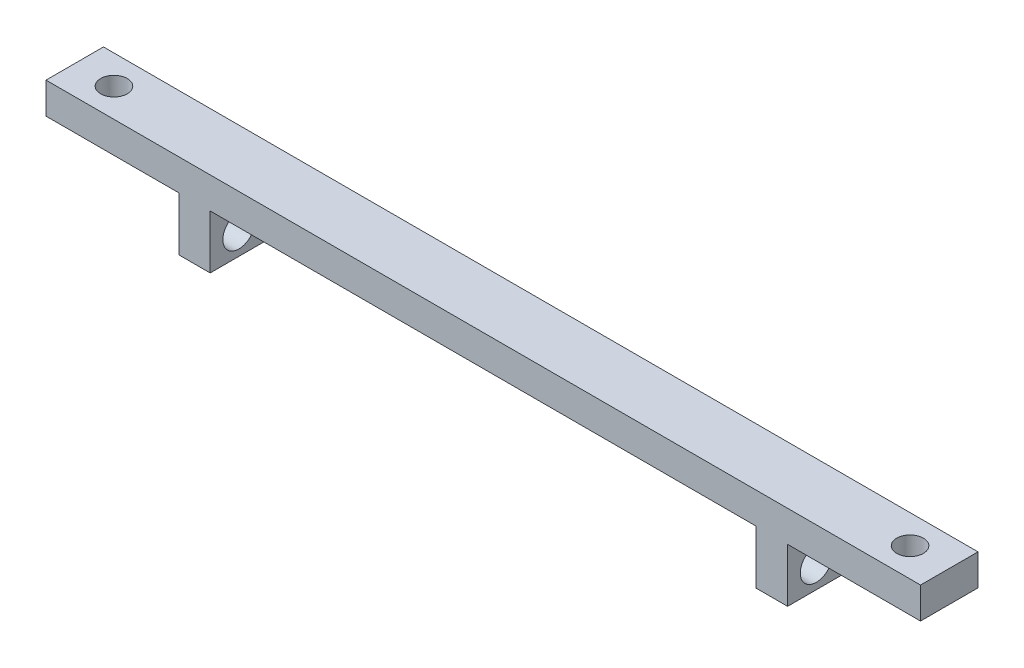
ISO-10303-21;
HEADER;
FILE_DESCRIPTION(('STEP AP214'),'2;1');
FILE_NAME('part.step','',(''),(''),'','','');
FILE_SCHEMA(('AUTOMOTIVE_DESIGN { 1 0 10303 214 1 1 1 1 }'));
ENDSEC;
DATA;
#1=APPLICATION_CONTEXT('core data for automotive mechanical design processes');
#2=APPLICATION_PROTOCOL_DEFINITION('international standard','automotive_design',2000,#1);
#3=PRODUCT_CONTEXT('',#1,'mechanical');
#4=PRODUCT('Part','Part','',(#3));
#5=PRODUCT_RELATED_PRODUCT_CATEGORY('part','',(#4));
#6=PRODUCT_DEFINITION_FORMATION('','',#4);
#7=PRODUCT_DEFINITION_CONTEXT('part definition',#1,'design');
#8=PRODUCT_DEFINITION('design','',#6,#7);
#9=PRODUCT_DEFINITION_SHAPE('','',#8);
#10=(LENGTH_UNIT() NAMED_UNIT(*) SI_UNIT(.MILLI.,.METRE.));
#11=(NAMED_UNIT(*) PLANE_ANGLE_UNIT() SI_UNIT($,.RADIAN.));
#12=(NAMED_UNIT(*) SI_UNIT($,.STERADIAN.) SOLID_ANGLE_UNIT());
#13=UNCERTAINTY_MEASURE_WITH_UNIT(LENGTH_MEASURE(1.E-05),#10,'distance_accuracy_value','');
#14=(GEOMETRIC_REPRESENTATION_CONTEXT(3) GLOBAL_UNCERTAINTY_ASSIGNED_CONTEXT((#13)) GLOBAL_UNIT_ASSIGNED_CONTEXT((#10,
#11,#12)) REPRESENTATION_CONTEXT('',''));
#15=CARTESIAN_POINT('',(0.,0.,0.));
#16=DIRECTION('',(0.,0.,1.));
#17=DIRECTION('',(1.,0.,0.));
#18=AXIS2_PLACEMENT_3D('',#15,#16,#17);
#19=CARTESIAN_POINT('',(0.,0.,-5.842));
#20=DIRECTION('',(0.,-1.,0.));
#21=DIRECTION('',(0.,0.,-1.));
#22=AXIS2_PLACEMENT_3D('',#19,#20,#21);
#23=PLANE('',#22);
#24=DIRECTION('',(0.,0.,1.));
#25=VECTOR('',#24,1.);
#26=CARTESIAN_POINT('',(16.6878,0.,-5.842));
#27=LINE('',#26,#25);
#28=CARTESIAN_POINT('',(16.6878,0.,-5.842));
#29=VERTEX_POINT('',#28);
#30=CARTESIAN_POINT('',(16.6878,0.,0.));
#31=VERTEX_POINT('',#30);
#32=EDGE_CURVE('E212',#29,#31,#27,.T.);
#33=ORIENTED_EDGE('',*,*,#32,.T.);
#34=DIRECTION('',(1.,0.,0.));
#35=VECTOR('',#34,1.);
#36=CARTESIAN_POINT('',(0.,0.,0.));
#37=LINE('',#36,#35);
#38=CARTESIAN_POINT('',(13.5128,0.,0.));
#39=VERTEX_POINT('',#38);
#40=EDGE_CURVE('E176',#39,#31,#37,.T.);
#41=ORIENTED_EDGE('',*,*,#40,.F.);
#42=DIRECTION('',(0.,0.,1.));
#43=VECTOR('',#42,1.);
#44=CARTESIAN_POINT('',(13.5128,0.,-5.842));
#45=LINE('',#44,#43);
#46=CARTESIAN_POINT('',(13.5128,0.,-5.842));
#47=VERTEX_POINT('',#46);
#48=EDGE_CURVE('E233',#47,#39,#45,.T.);
#49=ORIENTED_EDGE('',*,*,#48,.F.);
#50=DIRECTION('',(1.,0.,0.));
#51=VECTOR('',#50,1.);
#52=CARTESIAN_POINT('',(0.,0.,-5.842));
#53=LINE('',#52,#51);
#54=EDGE_CURVE('E157',#47,#29,#53,.T.);
#55=ORIENTED_EDGE('',*,*,#54,.T.);
#56=EDGE_LOOP('',(#33,#41,#49,#55));
#57=FACE_BOUND('',#56,.T.);
#58=ADVANCED_FACE('F43',(#57),#23,.T.);
#59=CARTESIAN_POINT('',(0.,0.,-5.842));
#60=DIRECTION('',(-1.,0.,0.));
#61=DIRECTION('',(0.,0.,1.));
#62=AXIS2_PLACEMENT_3D('',#59,#60,#61);
#63=PLANE('',#62);
#64=DIRECTION('',(0.,0.,1.));
#65=VECTOR('',#64,1.);
#66=CARTESIAN_POINT('',(0.,5.461,-5.842));
#67=LINE('',#66,#65);
#68=CARTESIAN_POINT('',(0.,5.461,-5.842));
#69=VERTEX_POINT('',#68);
#70=CARTESIAN_POINT('',(0.,5.461,0.));
#71=VERTEX_POINT('',#70);
#72=EDGE_CURVE('E175',#69,#71,#67,.T.);
#73=ORIENTED_EDGE('',*,*,#72,.T.);
#74=DIRECTION('',(0.,-1.,0.));
#75=VECTOR('',#74,1.);
#76=CARTESIAN_POINT('',(0.,0.,0.));
#77=LINE('',#76,#75);
#78=CARTESIAN_POINT('',(0.,8.636,0.));
#79=VERTEX_POINT('',#78);
#80=EDGE_CURVE('E171',#79,#71,#77,.T.);
#81=ORIENTED_EDGE('',*,*,#80,.F.);
#82=DIRECTION('',(0.,0.,1.));
#83=VECTOR('',#82,1.);
#84=CARTESIAN_POINT('',(0.,8.636,-5.842));
#85=LINE('',#84,#83);
#86=CARTESIAN_POINT('',(0.,8.636,-5.842));
#87=VERTEX_POINT('',#86);
#88=EDGE_CURVE('E13',#87,#79,#85,.T.);
#89=ORIENTED_EDGE('',*,*,#88,.F.);
#90=DIRECTION('',(0.,-1.,0.));
#91=VECTOR('',#90,1.);
#92=CARTESIAN_POINT('',(0.,0.,-5.842));
#93=LINE('',#92,#91);
#94=EDGE_CURVE('E158',#87,#69,#93,.T.);
#95=ORIENTED_EDGE('',*,*,#94,.T.);
#96=EDGE_LOOP('',(#73,#81,#89,#95));
#97=FACE_BOUND('',#96,.T.);
#98=ADVANCED_FACE('F45',(#97),#63,.T.);
#99=CARTESIAN_POINT('',(0.,8.636,-5.842));
#100=DIRECTION('',(0.,1.,0.));
#101=DIRECTION('',(0.,0.,1.));
#102=AXIS2_PLACEMENT_3D('',#99,#100,#101);
#103=PLANE('',#102);
#104=CARTESIAN_POINT('',(3.9878,8.636,-2.921));
#105=DIRECTION('',(0.,1.,0.));
#106=DIRECTION('',(0.,0.,1.));
#107=AXIS2_PLACEMENT_3D('',#104,#105,#106);
#108=CIRCLE('',#107,1.35254999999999);
#109=CARTESIAN_POINT('',(3.9878,8.636,-1.56845000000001));
#110=VERTEX_POINT('',#109);
#111=EDGE_CURVE('E303',#110,#110,#108,.T.);
#112=ORIENTED_EDGE('',*,*,#111,.F.);
#113=EDGE_LOOP('',(#112));
#114=FACE_BOUND('',#113,.T.);
#115=CARTESIAN_POINT('',(84.9122,8.636,-2.921));
#116=DIRECTION('',(0.,1.,0.));
#117=DIRECTION('',(0.,0.,1.));
#118=AXIS2_PLACEMENT_3D('',#115,#116,#117);
#119=CIRCLE('',#118,1.35254999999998);
#120=CARTESIAN_POINT('',(84.9122,8.636,-1.56845000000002));
#121=VERTEX_POINT('',#120);
#122=EDGE_CURVE('E316',#121,#121,#119,.T.);
#123=ORIENTED_EDGE('',*,*,#122,.F.);
#124=EDGE_LOOP('',(#123));
#125=FACE_BOUND('',#124,.T.);
#126=DIRECTION('',(-1.,0.,0.));
#127=VECTOR('',#126,1.);
#128=CARTESIAN_POINT('',(0.,8.636,0.));
#129=LINE('',#128,#127);
#130=CARTESIAN_POINT('',(88.9,8.636,0.));
#131=VERTEX_POINT('',#130);
#132=EDGE_CURVE('E163',#131,#79,#129,.T.);
#133=ORIENTED_EDGE('',*,*,#132,.F.);
#134=DIRECTION('',(0.,0.,1.));
#135=VECTOR('',#134,1.);
#136=CARTESIAN_POINT('',(88.9,8.636,-5.842));
#137=LINE('',#136,#135);
#138=CARTESIAN_POINT('',(88.9,8.636,-5.842));
#139=VERTEX_POINT('',#138);
#140=EDGE_CURVE('E52',#139,#131,#137,.T.);
#141=ORIENTED_EDGE('',*,*,#140,.F.);
#142=DIRECTION('',(-1.,0.,0.));
#143=VECTOR('',#142,1.);
#144=CARTESIAN_POINT('',(0.,8.636,-5.842));
#145=LINE('',#144,#143);
#146=EDGE_CURVE('E168',#139,#87,#145,.T.);
#147=ORIENTED_EDGE('',*,*,#146,.T.);
#148=ORIENTED_EDGE('',*,*,#88,.T.);
#149=EDGE_LOOP('',(#133,#141,#147,#148));
#150=FACE_BOUND('',#149,.T.);
#151=ADVANCED_FACE('F190',(#114,#125,#150),#103,.T.);
#152=CARTESIAN_POINT('',(88.9,0.,-5.842));
#153=DIRECTION('',(1.,0.,0.));
#154=DIRECTION('',(0.,0.,-1.));
#155=AXIS2_PLACEMENT_3D('',#152,#153,#154);
#156=PLANE('',#155);
#157=DIRECTION('',(0.,0.,1.));
#158=VECTOR('',#157,1.);
#159=CARTESIAN_POINT('',(88.9,5.461,-5.842));
#160=LINE('',#159,#158);
#161=CARTESIAN_POINT('',(88.9,5.461,-5.842));
#162=VERTEX_POINT('',#161);
#163=CARTESIAN_POINT('',(88.9,5.461,0.));
#164=VERTEX_POINT('',#163);
#165=EDGE_CURVE('E60',#162,#164,#160,.T.);
#166=ORIENTED_EDGE('',*,*,#165,.F.);
#167=DIRECTION('',(0.,1.,0.));
#168=VECTOR('',#167,1.);
#169=CARTESIAN_POINT('',(88.9,0.,-5.842));
#170=LINE('',#169,#168);
#171=EDGE_CURVE('E161',#162,#139,#170,.T.);
#172=ORIENTED_EDGE('',*,*,#171,.T.);
#173=ORIENTED_EDGE('',*,*,#140,.T.);
#174=DIRECTION('',(0.,1.,0.));
#175=VECTOR('',#174,1.);
#176=CARTESIAN_POINT('',(88.9,0.,0.));
#177=LINE('',#176,#175);
#178=EDGE_CURVE('E179',#164,#131,#177,.T.);
#179=ORIENTED_EDGE('',*,*,#178,.F.);
#180=EDGE_LOOP('',(#166,#172,#173,#179));
#181=FACE_BOUND('',#180,.T.);
#182=ADVANCED_FACE('F187',(#181),#156,.T.);
#183=DIRECTION('',(0.,0.,1.));
#184=VECTOR('',#183,1.);
#185=CARTESIAN_POINT('',(75.3872,0.,-5.842));
#186=LINE('',#185,#184);
#187=CARTESIAN_POINT('',(75.3872,0.,-5.842));
#188=VERTEX_POINT('',#187);
#189=CARTESIAN_POINT('',(75.3872,0.,0.));
#190=VERTEX_POINT('',#189);
#191=EDGE_CURVE('E135',#188,#190,#186,.T.);
#192=ORIENTED_EDGE('',*,*,#191,.T.);
#193=CARTESIAN_POINT('',(72.1868,0.,0.));
#194=VERTEX_POINT('',#193);
#195=EDGE_CURVE('E174',#194,#190,#37,.T.);
#196=ORIENTED_EDGE('',*,*,#195,.F.);
#197=DIRECTION('',(0.,0.,1.));
#198=VECTOR('',#197,1.);
#199=CARTESIAN_POINT('',(72.1868,0.,-5.842));
#200=LINE('',#199,#198);
#201=CARTESIAN_POINT('',(72.1868,0.,-5.842));
#202=VERTEX_POINT('',#201);
#203=EDGE_CURVE('E68',#202,#194,#200,.T.);
#204=ORIENTED_EDGE('',*,*,#203,.F.);
#205=EDGE_CURVE('E152',#202,#188,#53,.T.);
#206=ORIENTED_EDGE('',*,*,#205,.T.);
#207=EDGE_LOOP('',(#192,#196,#204,#206));
#208=FACE_BOUND('',#207,.T.);
#209=ADVANCED_FACE('F156',(#208),#23,.T.);
#210=CARTESIAN_POINT('',(0.,8.636,-5.842));
#211=DIRECTION('',(0.,0.,-1.));
#212=DIRECTION('',(-1.,0.,0.));
#213=AXIS2_PLACEMENT_3D('',#210,#211,#212);
#214=PLANE('',#213);
#215=DIRECTION('',(0.,-1.,0.));
#216=VECTOR('',#215,1.);
#217=CARTESIAN_POINT('',(75.3872,0.,-5.842));
#218=LINE('',#217,#216);
#219=CARTESIAN_POINT('',(75.3872,5.461,-5.842));
#220=VERTEX_POINT('',#219);
#221=EDGE_CURVE('E138',#220,#188,#218,.T.);
#222=ORIENTED_EDGE('',*,*,#221,.T.);
#223=ORIENTED_EDGE('',*,*,#205,.F.);
#224=DIRECTION('',(0.,1.,0.));
#225=VECTOR('',#224,1.);
#226=CARTESIAN_POINT('',(72.1868,0.,-5.842));
#227=LINE('',#226,#225);
#228=CARTESIAN_POINT('',(72.1868,5.461,-5.842));
#229=VERTEX_POINT('',#228);
#230=EDGE_CURVE('E206',#202,#229,#227,.T.);
#231=ORIENTED_EDGE('',*,*,#230,.T.);
#232=DIRECTION('',(-1.,0.,0.));
#233=VECTOR('',#232,1.);
#234=CARTESIAN_POINT('',(16.6878,5.461,-5.842));
#235=LINE('',#234,#233);
#236=CARTESIAN_POINT('',(16.6878,5.461,-5.842));
#237=VERTEX_POINT('',#236);
#238=EDGE_CURVE('E209',#229,#237,#235,.T.);
#239=ORIENTED_EDGE('',*,*,#238,.T.);
#240=DIRECTION('',(0.,-1.,0.));
#241=VECTOR('',#240,1.);
#242=CARTESIAN_POINT('',(16.6878,0.,-5.842));
#243=LINE('',#242,#241);
#244=EDGE_CURVE('E203',#237,#29,#243,.T.);
#245=ORIENTED_EDGE('',*,*,#244,.T.);
#246=ORIENTED_EDGE('',*,*,#54,.F.);
#247=DIRECTION('',(0.,1.,0.));
#248=VECTOR('',#247,1.);
#249=CARTESIAN_POINT('',(13.5128,0.,-5.842));
#250=LINE('',#249,#248);
#251=CARTESIAN_POINT('',(13.5128,5.461,-5.842));
#252=VERTEX_POINT('',#251);
#253=EDGE_CURVE('E226',#47,#252,#250,.T.);
#254=ORIENTED_EDGE('',*,*,#253,.T.);
#255=DIRECTION('',(-1.,0.,0.));
#256=VECTOR('',#255,1.);
#257=CARTESIAN_POINT('',(0.,5.461,-5.842));
#258=LINE('',#257,#256);
#259=EDGE_CURVE('E229',#252,#69,#258,.T.);
#260=ORIENTED_EDGE('',*,*,#259,.T.);
#261=ORIENTED_EDGE('',*,*,#94,.F.);
#262=ORIENTED_EDGE('',*,*,#146,.F.);
#263=ORIENTED_EDGE('',*,*,#171,.F.);
#264=DIRECTION('',(-1.,0.,0.));
#265=VECTOR('',#264,1.);
#266=CARTESIAN_POINT('',(75.3872,5.461,-5.842));
#267=LINE('',#266,#265);
#268=EDGE_CURVE('E146',#162,#220,#267,.T.);
#269=ORIENTED_EDGE('',*,*,#268,.T.);
#270=EDGE_LOOP('',(#222,#223,#231,#239,#245,#246,#254,#260,#261,#262,#263,#269));
#271=FACE_BOUND('',#270,.T.);
#272=ADVANCED_FACE('F150',(#271),#214,.T.);
#273=CARTESIAN_POINT('',(0.,8.636,0.));
#274=DIRECTION('',(0.,0.,-1.));
#275=DIRECTION('',(-1.,0.,0.));
#276=AXIS2_PLACEMENT_3D('',#273,#274,#275);
#277=PLANE('',#276);
#278=ORIENTED_EDGE('',*,*,#195,.T.);
#279=DIRECTION('',(0.,-1.,0.));
#280=VECTOR('',#279,1.);
#281=CARTESIAN_POINT('',(75.3872,0.,0.));
#282=LINE('',#281,#280);
#283=CARTESIAN_POINT('',(75.3872,5.461,0.));
#284=VERTEX_POINT('',#283);
#285=EDGE_CURVE('E141',#284,#190,#282,.T.);
#286=ORIENTED_EDGE('',*,*,#285,.F.);
#287=DIRECTION('',(-1.,0.,0.));
#288=VECTOR('',#287,1.);
#289=CARTESIAN_POINT('',(75.3872,5.461,0.));
#290=LINE('',#289,#288);
#291=EDGE_CURVE('E154',#164,#284,#290,.T.);
#292=ORIENTED_EDGE('',*,*,#291,.F.);
#293=ORIENTED_EDGE('',*,*,#178,.T.);
#294=ORIENTED_EDGE('',*,*,#132,.T.);
#295=ORIENTED_EDGE('',*,*,#80,.T.);
#296=DIRECTION('',(-1.,0.,0.));
#297=VECTOR('',#296,1.);
#298=CARTESIAN_POINT('',(0.,5.461,0.));
#299=LINE('',#298,#297);
#300=CARTESIAN_POINT('',(13.5128,5.461,0.));
#301=VERTEX_POINT('',#300);
#302=EDGE_CURVE('E230',#301,#71,#299,.T.);
#303=ORIENTED_EDGE('',*,*,#302,.F.);
#304=DIRECTION('',(0.,1.,0.));
#305=VECTOR('',#304,1.);
#306=CARTESIAN_POINT('',(13.5128,0.,0.));
#307=LINE('',#306,#305);
#308=EDGE_CURVE('E220',#39,#301,#307,.T.);
#309=ORIENTED_EDGE('',*,*,#308,.F.);
#310=ORIENTED_EDGE('',*,*,#40,.T.);
#311=DIRECTION('',(0.,-1.,0.));
#312=VECTOR('',#311,1.);
#313=CARTESIAN_POINT('',(16.6878,0.,0.));
#314=LINE('',#313,#312);
#315=CARTESIAN_POINT('',(16.6878,5.461,0.));
#316=VERTEX_POINT('',#315);
#317=EDGE_CURVE('E201',#316,#31,#314,.T.);
#318=ORIENTED_EDGE('',*,*,#317,.F.);
#319=DIRECTION('',(-1.,0.,0.));
#320=VECTOR('',#319,1.);
#321=CARTESIAN_POINT('',(16.6878,5.461,0.));
#322=LINE('',#321,#320);
#323=CARTESIAN_POINT('',(72.1868,5.461,0.));
#324=VERTEX_POINT('',#323);
#325=EDGE_CURVE('E207',#324,#316,#322,.T.);
#326=ORIENTED_EDGE('',*,*,#325,.F.);
#327=DIRECTION('',(0.,1.,0.));
#328=VECTOR('',#327,1.);
#329=CARTESIAN_POINT('',(72.1868,0.,0.));
#330=LINE('',#329,#328);
#331=EDGE_CURVE('E214',#194,#324,#330,.T.);
#332=ORIENTED_EDGE('',*,*,#331,.F.);
#333=EDGE_LOOP('',(#278,#286,#292,#293,#294,#295,#303,#309,#310,#318,#326,#332));
#334=FACE_BOUND('',#333,.T.);
#335=ADVANCED_FACE('F193',(#334),#277,.F.);
#336=CARTESIAN_POINT('',(0.,5.461,-5.842));
#337=DIRECTION('',(0.,1.,0.));
#338=DIRECTION('',(0.,0.,1.));
#339=AXIS2_PLACEMENT_3D('',#336,#337,#338);
#340=PLANE('',#339);
#341=CARTESIAN_POINT('',(3.9878,5.461,-2.921));
#342=DIRECTION('',(0.,1.,0.));
#343=DIRECTION('',(0.,0.,1.));
#344=AXIS2_PLACEMENT_3D('',#341,#342,#343);
#345=CIRCLE('',#344,1.35254999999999);
#346=CARTESIAN_POINT('',(3.9878,5.461,-1.56845000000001));
#347=VERTEX_POINT('',#346);
#348=EDGE_CURVE('E307',#347,#347,#345,.T.);
#349=ORIENTED_EDGE('',*,*,#348,.T.);
#350=EDGE_LOOP('',(#349));
#351=FACE_BOUND('',#350,.T.);
#352=ORIENTED_EDGE('',*,*,#302,.T.);
#353=ORIENTED_EDGE('',*,*,#72,.F.);
#354=ORIENTED_EDGE('',*,*,#259,.F.);
#355=DIRECTION('',(0.,0.,1.));
#356=VECTOR('',#355,1.);
#357=CARTESIAN_POINT('',(13.5128,5.461,-5.842));
#358=LINE('',#357,#356);
#359=EDGE_CURVE('E239',#252,#301,#358,.T.);
#360=ORIENTED_EDGE('',*,*,#359,.T.);
#361=EDGE_LOOP('',(#352,#353,#354,#360));
#362=FACE_BOUND('',#361,.T.);
#363=ADVANCED_FACE('F288',(#351,#362),#340,.F.);
#364=CARTESIAN_POINT('',(13.5128,0.,-5.842));
#365=DIRECTION('',(1.,0.,0.));
#366=DIRECTION('',(0.,0.,-1.));
#367=AXIS2_PLACEMENT_3D('',#364,#365,#366);
#368=PLANE('',#367);
#369=CARTESIAN_POINT('',(13.5128,2.286,-2.921));
#370=DIRECTION('',(1.,0.,0.));
#371=DIRECTION('',(0.,0.,-1.));
#372=AXIS2_PLACEMENT_3D('',#369,#370,#371);
#373=CIRCLE('',#372,1.63194999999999);
#374=CARTESIAN_POINT('',(13.5128,2.286,-4.55294999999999));
#375=VERTEX_POINT('',#374);
#376=EDGE_CURVE('E304',#375,#375,#373,.T.);
#377=ORIENTED_EDGE('',*,*,#376,.T.);
#378=EDGE_LOOP('',(#377));
#379=FACE_BOUND('',#378,.T.);
#380=ORIENTED_EDGE('',*,*,#308,.T.);
#381=ORIENTED_EDGE('',*,*,#359,.F.);
#382=ORIENTED_EDGE('',*,*,#253,.F.);
#383=ORIENTED_EDGE('',*,*,#48,.T.);
#384=EDGE_LOOP('',(#380,#381,#382,#383));
#385=FACE_BOUND('',#384,.T.);
#386=ADVANCED_FACE('F243',(#379,#385),#368,.F.);
#387=CARTESIAN_POINT('',(16.6878,0.,-5.842));
#388=DIRECTION('',(-1.,0.,0.));
#389=DIRECTION('',(0.,0.,1.));
#390=AXIS2_PLACEMENT_3D('',#387,#388,#389);
#391=PLANE('',#390);
#392=CARTESIAN_POINT('',(16.6878,2.286,-2.921));
#393=DIRECTION('',(-1.,0.,0.));
#394=DIRECTION('',(0.,0.,1.));
#395=AXIS2_PLACEMENT_3D('',#392,#393,#394);
#396=CIRCLE('',#395,1.63194999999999);
#397=CARTESIAN_POINT('',(16.6878,2.286,-1.28905000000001));
#398=VERTEX_POINT('',#397);
#399=EDGE_CURVE('E301',#398,#398,#396,.T.);
#400=ORIENTED_EDGE('',*,*,#399,.T.);
#401=EDGE_LOOP('',(#400));
#402=FACE_BOUND('',#401,.T.);
#403=ORIENTED_EDGE('',*,*,#317,.T.);
#404=ORIENTED_EDGE('',*,*,#32,.F.);
#405=ORIENTED_EDGE('',*,*,#244,.F.);
#406=DIRECTION('',(0.,0.,1.));
#407=VECTOR('',#406,1.);
#408=CARTESIAN_POINT('',(16.6878,5.461,-5.842));
#409=LINE('',#408,#407);
#410=EDGE_CURVE('E218',#237,#316,#409,.T.);
#411=ORIENTED_EDGE('',*,*,#410,.T.);
#412=EDGE_LOOP('',(#403,#404,#405,#411));
#413=FACE_BOUND('',#412,.T.);
#414=ADVANCED_FACE('F250',(#402,#413),#391,.F.);
#415=CARTESIAN_POINT('',(16.6878,5.461,-5.842));
#416=DIRECTION('',(0.,1.,0.));
#417=DIRECTION('',(0.,0.,1.));
#418=AXIS2_PLACEMENT_3D('',#415,#416,#417);
#419=PLANE('',#418);
#420=ORIENTED_EDGE('',*,*,#325,.T.);
#421=ORIENTED_EDGE('',*,*,#410,.F.);
#422=ORIENTED_EDGE('',*,*,#238,.F.);
#423=DIRECTION('',(0.,0.,1.));
#424=VECTOR('',#423,1.);
#425=CARTESIAN_POINT('',(72.1868,5.461,-5.842));
#426=LINE('',#425,#424);
#427=EDGE_CURVE('E221',#229,#324,#426,.T.);
#428=ORIENTED_EDGE('',*,*,#427,.T.);
#429=EDGE_LOOP('',(#420,#421,#422,#428));
#430=FACE_BOUND('',#429,.T.);
#431=ADVANCED_FACE('F253',(#430),#419,.F.);
#432=CARTESIAN_POINT('',(72.1868,0.,-5.842));
#433=DIRECTION('',(1.,0.,0.));
#434=DIRECTION('',(0.,0.,-1.));
#435=AXIS2_PLACEMENT_3D('',#432,#433,#434);
#436=PLANE('',#435);
#437=CARTESIAN_POINT('',(72.1868,2.286,-2.921));
#438=DIRECTION('',(1.,0.,0.));
#439=DIRECTION('',(0.,0.,-1.));
#440=AXIS2_PLACEMENT_3D('',#437,#438,#439);
#441=CIRCLE('',#440,1.63194999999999);
#442=CARTESIAN_POINT('',(72.1868,2.286,-4.55294999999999));
#443=VERTEX_POINT('',#442);
#444=EDGE_CURVE('E310',#443,#443,#441,.T.);
#445=ORIENTED_EDGE('',*,*,#444,.T.);
#446=EDGE_LOOP('',(#445));
#447=FACE_BOUND('',#446,.T.);
#448=ORIENTED_EDGE('',*,*,#331,.T.);
#449=ORIENTED_EDGE('',*,*,#427,.F.);
#450=ORIENTED_EDGE('',*,*,#230,.F.);
#451=ORIENTED_EDGE('',*,*,#203,.T.);
#452=EDGE_LOOP('',(#448,#449,#450,#451));
#453=FACE_BOUND('',#452,.T.);
#454=ADVANCED_FACE('F255',(#447,#453),#436,.F.);
#455=CARTESIAN_POINT('',(75.3872,0.,-5.842));
#456=DIRECTION('',(-1.,0.,0.));
#457=DIRECTION('',(0.,0.,1.));
#458=AXIS2_PLACEMENT_3D('',#455,#456,#457);
#459=PLANE('',#458);
#460=CARTESIAN_POINT('',(75.3872,2.286,-2.921));
#461=DIRECTION('',(1.,0.,0.));
#462=DIRECTION('',(0.,0.,-1.));
#463=AXIS2_PLACEMENT_3D('',#460,#461,#462);
#464=CIRCLE('',#463,1.63194999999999);
#465=CARTESIAN_POINT('',(75.3872,2.286,-4.55294999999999));
#466=VERTEX_POINT('',#465);
#467=EDGE_CURVE('E350',#466,#466,#464,.T.);
#468=ORIENTED_EDGE('',*,*,#467,.F.);
#469=EDGE_LOOP('',(#468));
#470=FACE_BOUND('',#469,.T.);
#471=ORIENTED_EDGE('',*,*,#285,.T.);
#472=ORIENTED_EDGE('',*,*,#191,.F.);
#473=ORIENTED_EDGE('',*,*,#221,.F.);
#474=DIRECTION('',(0.,0.,1.));
#475=VECTOR('',#474,1.);
#476=CARTESIAN_POINT('',(75.3872,5.461,-5.842));
#477=LINE('',#476,#475);
#478=EDGE_CURVE('E199',#220,#284,#477,.T.);
#479=ORIENTED_EDGE('',*,*,#478,.T.);
#480=EDGE_LOOP('',(#471,#472,#473,#479));
#481=FACE_BOUND('',#480,.T.);
#482=ADVANCED_FACE('F137',(#470,#481),#459,.F.);
#483=CARTESIAN_POINT('',(75.3872,5.461,-5.842));
#484=DIRECTION('',(0.,1.,0.));
#485=DIRECTION('',(0.,0.,1.));
#486=AXIS2_PLACEMENT_3D('',#483,#484,#485);
#487=PLANE('',#486);
#488=CARTESIAN_POINT('',(84.9122,5.461,-2.921));
#489=DIRECTION('',(0.,1.,0.));
#490=DIRECTION('',(0.,0.,1.));
#491=AXIS2_PLACEMENT_3D('',#488,#489,#490);
#492=CIRCLE('',#491,1.35254999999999);
#493=CARTESIAN_POINT('',(84.9122,5.461,-1.56845000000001));
#494=VERTEX_POINT('',#493);
#495=EDGE_CURVE('E47',#494,#494,#492,.T.);
#496=ORIENTED_EDGE('',*,*,#495,.T.);
#497=EDGE_LOOP('',(#496));
#498=FACE_BOUND('',#497,.T.);
#499=ORIENTED_EDGE('',*,*,#291,.T.);
#500=ORIENTED_EDGE('',*,*,#478,.F.);
#501=ORIENTED_EDGE('',*,*,#268,.F.);
#502=ORIENTED_EDGE('',*,*,#165,.T.);
#503=EDGE_LOOP('',(#499,#500,#501,#502));
#504=FACE_BOUND('',#503,.T.);
#505=ADVANCED_FACE('F263',(#498,#504),#487,.F.);
#506=CARTESIAN_POINT('',(84.9122,8.636,-2.921));
#507=DIRECTION('',(0.,1.,0.));
#508=DIRECTION('',(0.,0.,1.));
#509=AXIS2_PLACEMENT_3D('',#506,#507,#508);
#510=CYLINDRICAL_SURFACE('',#509,1.35254999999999);
#511=ORIENTED_EDGE('',*,*,#122,.T.);
#512=EDGE_LOOP('',(#511));
#513=FACE_BOUND('',#512,.T.);
#514=ORIENTED_EDGE('',*,*,#495,.F.);
#515=EDGE_LOOP('',(#514));
#516=FACE_BOUND('',#515,.T.);
#517=ADVANCED_FACE('F324',(#513,#516),#510,.F.);
#518=CARTESIAN_POINT('',(3.9878,8.636,-2.921));
#519=DIRECTION('',(0.,1.,0.));
#520=DIRECTION('',(0.,0.,1.));
#521=AXIS2_PLACEMENT_3D('',#518,#519,#520);
#522=CYLINDRICAL_SURFACE('',#521,1.35254999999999);
#523=ORIENTED_EDGE('',*,*,#111,.T.);
#524=EDGE_LOOP('',(#523));
#525=FACE_BOUND('',#524,.T.);
#526=ORIENTED_EDGE('',*,*,#348,.F.);
#527=EDGE_LOOP('',(#526));
#528=FACE_BOUND('',#527,.T.);
#529=ADVANCED_FACE('F326',(#525,#528),#522,.F.);
#530=CARTESIAN_POINT('',(75.3872,2.286,-2.921));
#531=DIRECTION('',(1.,0.,0.));
#532=DIRECTION('',(0.,0.,-1.));
#533=AXIS2_PLACEMENT_3D('',#530,#531,#532);
#534=CYLINDRICAL_SURFACE('',#533,1.63194999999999);
#535=ORIENTED_EDGE('',*,*,#467,.T.);
#536=EDGE_LOOP('',(#535));
#537=FACE_BOUND('',#536,.T.);
#538=ORIENTED_EDGE('',*,*,#444,.F.);
#539=EDGE_LOOP('',(#538));
#540=FACE_BOUND('',#539,.T.);
#541=ADVANCED_FACE('F332',(#537,#540),#534,.F.);
#542=ORIENTED_EDGE('',*,*,#376,.F.);
#543=EDGE_LOOP('',(#542));
#544=FACE_BOUND('',#543,.T.);
#545=ORIENTED_EDGE('',*,*,#399,.F.);
#546=EDGE_LOOP('',(#545));
#547=FACE_BOUND('',#546,.T.);
#548=ADVANCED_FACE('F337',(#544,#547),#534,.F.);
#549=CLOSED_SHELL('',(#58,#98,#151,#182,#209,#272,#335,#363,#386,#414,#431,#454,#482,#505,#517,
#529,#541,#548));
#550=MANIFOLD_SOLID_BREP('B2',#549);
#551=ADVANCED_BREP_SHAPE_REPRESENTATION('',(#18,#550),#14);
#552=SHAPE_DEFINITION_REPRESENTATION(#9,#551);
ENDSEC;
END-ISO-10303-21;
